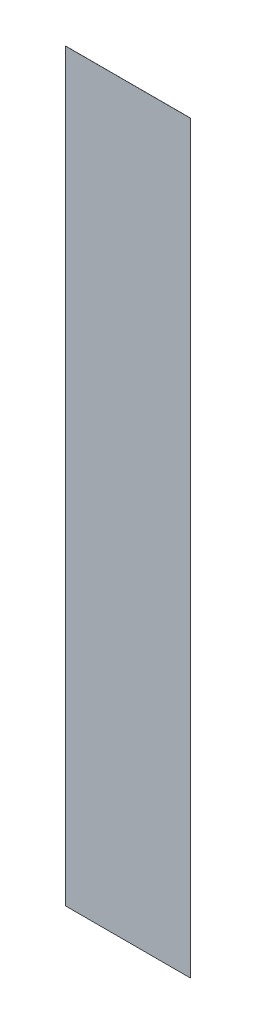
ISO-10303-21;
HEADER;
FILE_DESCRIPTION(('STEP AP214'),'2;1');
FILE_NAME('part.step','',(''),(''),'','','');
FILE_SCHEMA(('AUTOMOTIVE_DESIGN { 1 0 10303 214 1 1 1 1 }'));
ENDSEC;
DATA;
#1=APPLICATION_CONTEXT('core data for automotive mechanical design processes');
#2=APPLICATION_PROTOCOL_DEFINITION('international standard','automotive_design',2000,#1);
#3=PRODUCT_CONTEXT('',#1,'mechanical');
#4=PRODUCT('Part','Part','',(#3));
#5=PRODUCT_RELATED_PRODUCT_CATEGORY('part','',(#4));
#6=PRODUCT_DEFINITION_FORMATION('','',#4);
#7=PRODUCT_DEFINITION_CONTEXT('part definition',#1,'design');
#8=PRODUCT_DEFINITION('design','',#6,#7);
#9=PRODUCT_DEFINITION_SHAPE('','',#8);
#10=(LENGTH_UNIT() NAMED_UNIT(*) SI_UNIT(.MILLI.,.METRE.));
#11=(NAMED_UNIT(*) PLANE_ANGLE_UNIT() SI_UNIT($,.RADIAN.));
#12=(NAMED_UNIT(*) SI_UNIT($,.STERADIAN.) SOLID_ANGLE_UNIT());
#13=UNCERTAINTY_MEASURE_WITH_UNIT(LENGTH_MEASURE(1.E-05),#10,'distance_accuracy_value','');
#14=(GEOMETRIC_REPRESENTATION_CONTEXT(3) GLOBAL_UNCERTAINTY_ASSIGNED_CONTEXT((#13)) GLOBAL_UNIT_ASSIGNED_CONTEXT((#10,
#11,#12)) REPRESENTATION_CONTEXT('',''));
#15=CARTESIAN_POINT('',(0.,0.,0.));
#16=DIRECTION('',(0.,0.,1.));
#17=DIRECTION('',(1.,0.,0.));
#18=AXIS2_PLACEMENT_3D('',#15,#16,#17);
#19=CARTESIAN_POINT('',(4.98956219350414,36.3,-5.766));
#20=DIRECTION('',(0.,0.,1.));
#21=DIRECTION('',(1.,0.,0.));
#22=AXIS2_PLACEMENT_3D('',#19,#20,#21);
#23=PLANE('',#22);
#24=DIRECTION('',(0.,1.,0.));
#25=VECTOR('',#24,1.);
#26=CARTESIAN_POINT('',(9.63621930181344,22.3,-5.766));
#27=LINE('',#26,#25);
#28=CARTESIAN_POINT('',(9.63621930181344,2.3,-5.766));
#29=VERTEX_POINT('',#28);
#30=CARTESIAN_POINT('',(9.63621930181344,10.,-5.766));
#31=VERTEX_POINT('',#30);
#32=EDGE_CURVE('E39',#29,#31,#27,.T.);
#33=ORIENTED_EDGE('',*,*,#32,.F.);
#34=DIRECTION('',(1.,0.,0.));
#35=VECTOR('',#34,1.);
#36=CARTESIAN_POINT('',(6.66767450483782,2.3,-5.766));
#37=LINE('',#36,#35);
#38=CARTESIAN_POINT('',(8.34578681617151,2.3,-5.766));
#39=VERTEX_POINT('',#38);
#40=EDGE_CURVE('E10',#39,#29,#37,.T.);
#41=ORIENTED_EDGE('',*,*,#40,.F.);
#42=DIRECTION('',(0.,-1.,0.));
#43=VECTOR('',#42,1.);
#44=CARTESIAN_POINT('',(8.34578681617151,23.15,-5.766));
#45=LINE('',#44,#43);
#46=CARTESIAN_POINT('',(8.34578681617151,10.,-5.766));
#47=VERTEX_POINT('',#46);
#48=EDGE_CURVE('E75',#47,#39,#45,.T.);
#49=ORIENTED_EDGE('',*,*,#48,.F.);
#50=DIRECTION('',(-1.,0.,0.));
#51=VECTOR('',#50,1.);
#52=CARTESIAN_POINT('',(7.31289074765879,10.,-5.766));
#53=LINE('',#52,#51);
#54=EDGE_CURVE('E65',#31,#47,#53,.T.);
#55=ORIENTED_EDGE('',*,*,#54,.F.);
#56=EDGE_LOOP('',(#33,#41,#49,#55));
#57=FACE_BOUND('',#56,.T.);
#58=ADVANCED_FACE('F15',(#57),#23,.F.);
#59=CARTESIAN_POINT('',(8.34578681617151,2.3,-5.775));
#60=DIRECTION('',(0.,-1.,0.));
#61=DIRECTION('',(0.,0.,-1.));
#62=AXIS2_PLACEMENT_3D('',#59,#60,#61);
#63=PLANE('',#62);
#64=ORIENTED_EDGE('',*,*,#40,.T.);
#65=DIRECTION('',(0.,0.,1.));
#66=VECTOR('',#65,1.);
#67=CARTESIAN_POINT('',(9.63621930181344,2.3,-5.775));
#68=LINE('',#67,#66);
#69=CARTESIAN_POINT('',(9.63621930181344,2.3,-5.765));
#70=VERTEX_POINT('',#69);
#71=EDGE_CURVE('E25',#29,#70,#68,.T.);
#72=ORIENTED_EDGE('',*,*,#71,.T.);
#73=DIRECTION('',(-1.,0.,0.));
#74=VECTOR('',#73,1.);
#75=CARTESIAN_POINT('',(15.4910030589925,2.3,-5.765));
#76=LINE('',#75,#74);
#77=CARTESIAN_POINT('',(8.34578681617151,2.3,-5.765));
#78=VERTEX_POINT('',#77);
#79=EDGE_CURVE('E99',#70,#78,#76,.T.);
#80=ORIENTED_EDGE('',*,*,#79,.T.);
#81=DIRECTION('',(0.,0.,-1.));
#82=VECTOR('',#81,1.);
#83=CARTESIAN_POINT('',(8.34578681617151,2.3,-5.775));
#84=LINE('',#83,#82);
#85=EDGE_CURVE('E94',#78,#39,#84,.T.);
#86=ORIENTED_EDGE('',*,*,#85,.T.);
#87=EDGE_LOOP('',(#64,#72,#80,#86));
#88=FACE_BOUND('',#87,.T.);
#89=ADVANCED_FACE('F114',(#88),#63,.T.);
#90=CARTESIAN_POINT('',(9.63621930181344,8.3,-5.775));
#91=DIRECTION('',(1.,0.,0.));
#92=DIRECTION('',(0.,1.,0.));
#93=AXIS2_PLACEMENT_3D('',#90,#91,#92);
#94=PLANE('',#93);
#95=ORIENTED_EDGE('',*,*,#32,.T.);
#96=DIRECTION('',(0.,0.,1.));
#97=VECTOR('',#96,1.);
#98=CARTESIAN_POINT('',(9.63621930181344,10.,-5.775));
#99=LINE('',#98,#97);
#100=CARTESIAN_POINT('',(9.63621930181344,10.,-5.765));
#101=VERTEX_POINT('',#100);
#102=EDGE_CURVE('E73',#31,#101,#99,.T.);
#103=ORIENTED_EDGE('',*,*,#102,.T.);
#104=DIRECTION('',(0.,-1.,0.));
#105=VECTOR('',#104,1.);
#106=CARTESIAN_POINT('',(9.63621930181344,8.3,-5.765));
#107=LINE('',#106,#105);
#108=EDGE_CURVE('E80',#101,#70,#107,.T.);
#109=ORIENTED_EDGE('',*,*,#108,.T.);
#110=ORIENTED_EDGE('',*,*,#71,.F.);
#111=EDGE_LOOP('',(#95,#103,#109,#110));
#112=FACE_BOUND('',#111,.T.);
#113=ADVANCED_FACE('F108',(#112),#94,.T.);
#114=CARTESIAN_POINT('',(8.34578681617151,10.,-5.775));
#115=DIRECTION('',(-1.,0.,0.));
#116=DIRECTION('',(0.,0.,1.));
#117=AXIS2_PLACEMENT_3D('',#114,#115,#116);
#118=PLANE('',#117);
#119=ORIENTED_EDGE('',*,*,#48,.T.);
#120=ORIENTED_EDGE('',*,*,#85,.F.);
#121=DIRECTION('',(0.,-1.,0.));
#122=VECTOR('',#121,1.);
#123=CARTESIAN_POINT('',(8.34578681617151,2.3,-5.765));
#124=LINE('',#123,#122);
#125=CARTESIAN_POINT('',(8.34578681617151,10.,-5.765));
#126=VERTEX_POINT('',#125);
#127=EDGE_CURVE('E18',#126,#78,#124,.T.);
#128=ORIENTED_EDGE('',*,*,#127,.F.);
#129=DIRECTION('',(0.,0.,1.));
#130=VECTOR('',#129,1.);
#131=CARTESIAN_POINT('',(8.34578681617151,10.,-5.775));
#132=LINE('',#131,#130);
#133=EDGE_CURVE('E70',#47,#126,#132,.T.);
#134=ORIENTED_EDGE('',*,*,#133,.F.);
#135=EDGE_LOOP('',(#119,#120,#128,#134));
#136=FACE_BOUND('',#135,.T.);
#137=ADVANCED_FACE('F82',(#136),#118,.T.);
#138=CARTESIAN_POINT('',(9.63621930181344,10.,-5.775));
#139=DIRECTION('',(0.,1.,0.));
#140=DIRECTION('',(1.,0.,0.));
#141=AXIS2_PLACEMENT_3D('',#138,#139,#140);
#142=PLANE('',#141);
#143=ORIENTED_EDGE('',*,*,#54,.T.);
#144=ORIENTED_EDGE('',*,*,#133,.T.);
#145=DIRECTION('',(-1.,0.,0.));
#146=VECTOR('',#145,1.);
#147=CARTESIAN_POINT('',(6.99028262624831,10.,-5.765));
#148=LINE('',#147,#146);
#149=EDGE_CURVE('E85',#101,#126,#148,.T.);
#150=ORIENTED_EDGE('',*,*,#149,.F.);
#151=ORIENTED_EDGE('',*,*,#102,.F.);
#152=EDGE_LOOP('',(#143,#144,#150,#151));
#153=FACE_BOUND('',#152,.T.);
#154=ADVANCED_FACE('F67',(#153),#142,.T.);
#155=CARTESIAN_POINT('',(4.98956219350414,36.3,-5.765));
#156=DIRECTION('',(0.,0.,1.));
#157=DIRECTION('',(1.,0.,0.));
#158=AXIS2_PLACEMENT_3D('',#155,#156,#157);
#159=PLANE('',#158);
#160=ORIENTED_EDGE('',*,*,#108,.F.);
#161=ORIENTED_EDGE('',*,*,#149,.T.);
#162=ORIENTED_EDGE('',*,*,#127,.T.);
#163=ORIENTED_EDGE('',*,*,#79,.F.);
#164=EDGE_LOOP('',(#160,#161,#162,#163));
#165=FACE_BOUND('',#164,.T.);
#166=ADVANCED_FACE('F112',(#165),#159,.T.);
#167=CLOSED_SHELL('',(#58,#89,#113,#137,#154,#166));
#168=MANIFOLD_SOLID_BREP('B1',#167);
#169=ADVANCED_BREP_SHAPE_REPRESENTATION('',(#18,#168),#14);
#170=SHAPE_DEFINITION_REPRESENTATION(#9,#169);
ENDSEC;
END-ISO-10303-21;
